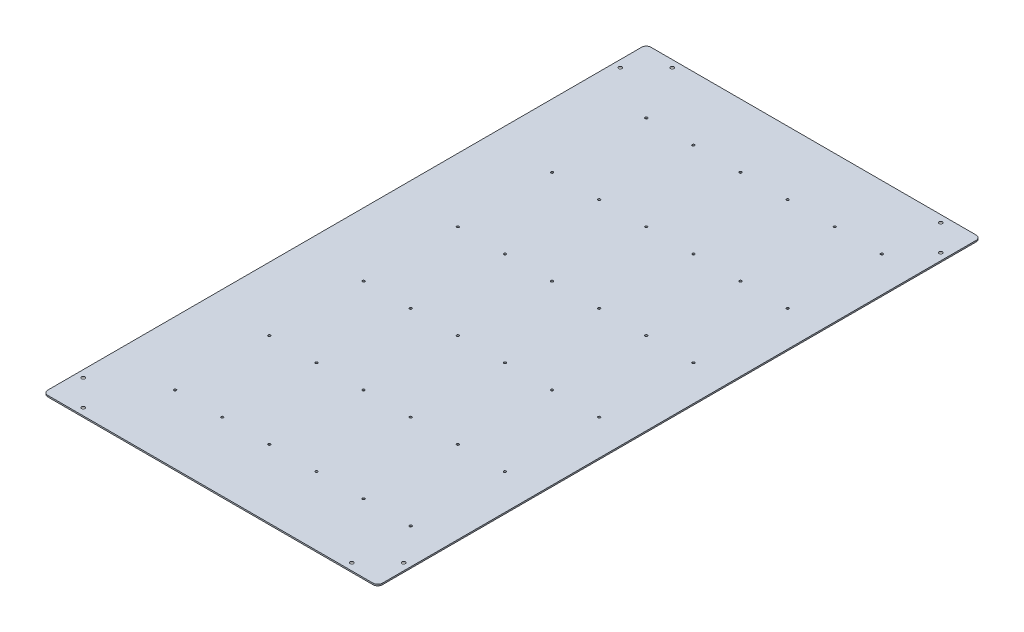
from build123d import *

# Parameters (mm, degrees)
SKETCH_1_W                  = 710
SKETCH_1_H                  = 1280
EXTRUDE_1_DEPTH             = 3
HOLE_WIZARD_M6_1_AT_2_COUNT = 2
HOLE_WIZARD_M6_1_AT_2_PITCH = 77.781745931
HOLE_WIZARD_M6_1_AT_3_COUNT = 2
HOLE_WIZARD_M6_1_AT_3_PITCH = 1196.265020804
HOLE_WIZARD_M6_1_AT_4_COUNT = 2
HOLE_WIZARD_M6_1_AT_4_PITCH = 1250
HOLE_WIZARD_M6_1_AT_5_COUNT = 2
HOLE_WIZARD_M6_1_AT_5_PITCH = 1373.826772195
HOLE_WIZARD_M6_1_AT_6_COUNT = 2
HOLE_WIZARD_M6_1_AT_6_PITCH = 1348.573320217
HOLE_WIZARD_M6_1_AT_7_COUNT = 2
HOLE_WIZARD_M6_1_AT_7_PITCH = 627.415332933
HOLE_WIZARD_M6_1_AT_8_COUNT = 2
HOLE_WIZARD_M6_1_AT_8_PITCH = 570
HOLE_WIZARD_M6_1_2_D        = 5
PATTERN_LINEAR_1_COUNT      = 6
PATTERN_LINEAR_1_PITCH      = 200
PATTERN_LINEAR_1_COUNT_DIR2 = 6
PATTERN_LINEAR_1_PITCH_DIR2 = 100
FILLET_1_R                  = 10


with BuildPart() as part:
    # Sketch 1 → Extrude 1 (new body)
    with BuildSketch(Plane(origin=(0, 0, 0), x_dir=(1, 0, 0), z_dir=(0, 1, 0))):
        Rectangle(SKETCH_1_W, SKETCH_1_H)
    extrude(amount=EXTRUDE_1_DEPTH)

    # Sketch 5 → Hole Wizard M6 _1 (revolve, cut)
    with BuildSketch(Plane(origin=(285, 0, -625), x_dir=(0, 0, -1), z_dir=(1, 0, 0))):
        Polygon((0, 0), (0, 3), (3.5, 3), (3.5, 2.9), (6.4, 0), align=None)
    hole_wizard_m6_1 = revolve(axis=Axis((285, -6.35, -625), (0, 1, 0)), mode=Mode.SUBTRACT)

    # Hole Wizard M6 _1 at 2: Hole Wizard M6 _1 ×2
    with Locations(*[Vector(0.7071067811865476, 0, 0.7071067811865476) * (i * HOLE_WIZARD_M6_1_AT_2_PITCH) for i in range(1, HOLE_WIZARD_M6_1_AT_2_COUNT)]):
        add(hole_wizard_m6_1, mode=Mode.SUBTRACT)

    # Hole Wizard M6 _1 at 3: Hole Wizard M6 _1 ×2
    with Locations(*[Vector(0.04597643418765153, 0, 0.9989425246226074) * (i * HOLE_WIZARD_M6_1_AT_3_PITCH) for i in range(1, HOLE_WIZARD_M6_1_AT_3_COUNT)]):
        add(hole_wizard_m6_1, mode=Mode.SUBTRACT)

    # Hole Wizard M6 _1 at 4: Hole Wizard M6 _1 ×2
    with Locations(*[(0, 0, i * HOLE_WIZARD_M6_1_AT_4_PITCH) for i in range(1, HOLE_WIZARD_M6_1_AT_4_COUNT)]):
        add(hole_wizard_m6_1, mode=Mode.SUBTRACT)

    # Hole Wizard M6 _1 at 5: Hole Wizard M6 _1 ×2
    with Locations(*[Vector(-0.4148994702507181, 0, 0.9098672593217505) * (i * HOLE_WIZARD_M6_1_AT_5_PITCH) for i in range(1, HOLE_WIZARD_M6_1_AT_5_COUNT)]):
        add(hole_wizard_m6_1, mode=Mode.SUBTRACT)

    # Hole Wizard M6 _1 at 6: Hole Wizard M6 _1 ×2
    with Locations(*[Vector(-0.463452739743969, 0, 0.886121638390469) * (i * HOLE_WIZARD_M6_1_AT_6_PITCH) for i in range(1, HOLE_WIZARD_M6_1_AT_6_COUNT)]):
        add(hole_wizard_m6_1, mode=Mode.SUBTRACT)

    # Hole Wizard M6 _1 at 7: Hole Wizard M6 _1 ×2
    with Locations(*[Vector(-0.9961503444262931, 0, 0.08766123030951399) * (i * HOLE_WIZARD_M6_1_AT_7_PITCH) for i in range(1, HOLE_WIZARD_M6_1_AT_7_COUNT)]):
        add(hole_wizard_m6_1, mode=Mode.SUBTRACT)

    # Hole Wizard M6 _1 at 8: Hole Wizard M6 _1 ×2
    with Locations(*[(-i * HOLE_WIZARD_M6_1_AT_8_PITCH, 0, 0) for i in range(1, HOLE_WIZARD_M6_1_AT_8_COUNT)]):
        add(hole_wizard_m6_1, mode=Mode.SUBTRACT)

    # Hole Wizard M6 _1 2 (through all)
    with Locations(Plane(origin=(0, 3, 0), x_dir=(1, 0, 0), z_dir=(0, 1, 0))):
        with Locations((-220, -495)):
            hole_wizard_m6_1_2 = Hole(HOLE_WIZARD_M6_1_2_D / 2)

    # Pattern Linear 1: Hole Wizard M6 _1 2 6 × 6
    with Locations(*[(j * PATTERN_LINEAR_1_PITCH_DIR2, 0, -i * PATTERN_LINEAR_1_PITCH) for i in range(PATTERN_LINEAR_1_COUNT) for j in range(PATTERN_LINEAR_1_COUNT_DIR2) if (i, j) != (0, 0)]):
        add(hole_wizard_m6_1_2, mode=Mode.SUBTRACT)

    # Fillet 1
    fillet_1_edges = [part.edges().sort_by_distance(p)[0] for p in [
        (355, 1.5, 640),
        (-355, 1.5, 640),
        (-355, 1.5, -640),
        (355, 1.5, -640),
    ]]
    fillet(fillet_1_edges, radius=FILLET_1_R)


solid = part.part
